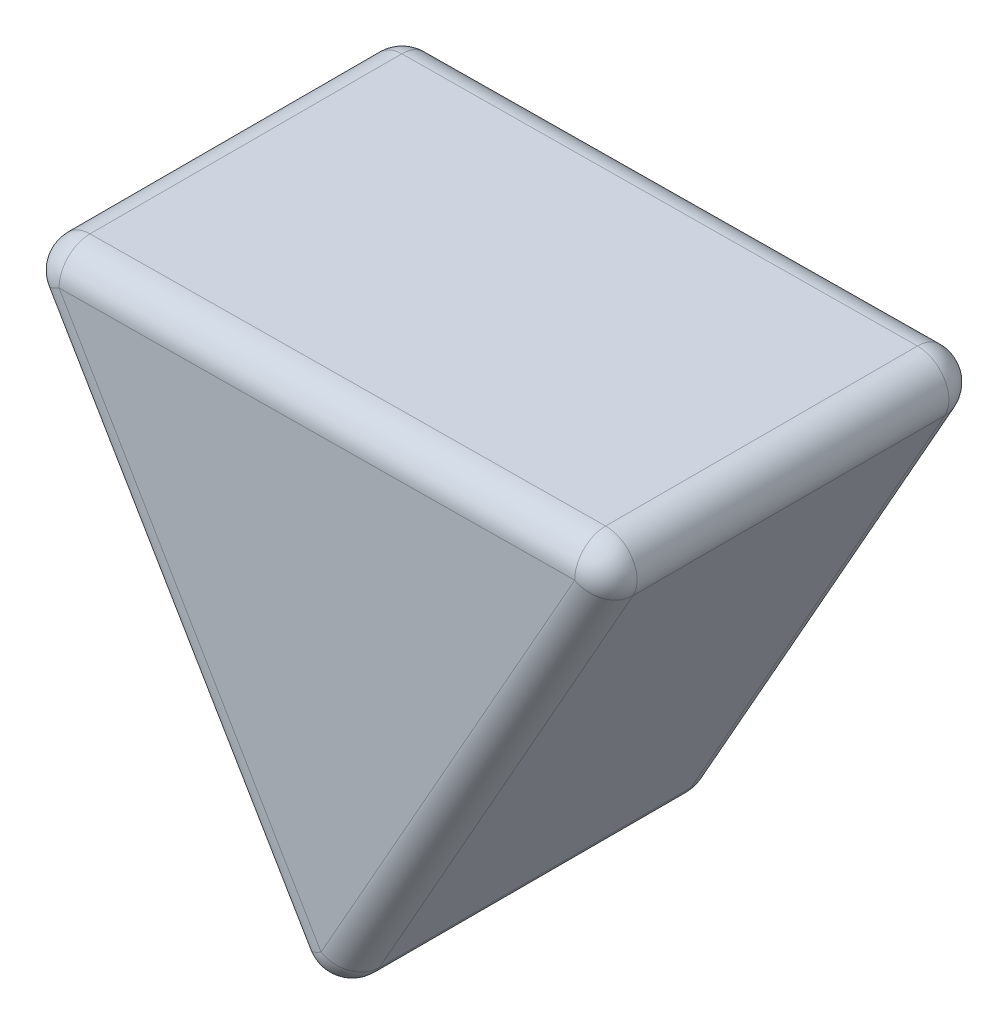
ISO-10303-21;
HEADER;
FILE_DESCRIPTION(('STEP AP214'),'2;1');
FILE_NAME('part.step','',(''),(''),'','','');
FILE_SCHEMA(('AUTOMOTIVE_DESIGN { 1 0 10303 214 1 1 1 1 }'));
ENDSEC;
DATA;
#1=APPLICATION_CONTEXT('core data for automotive mechanical design processes');
#2=APPLICATION_PROTOCOL_DEFINITION('international standard','automotive_design',2000,#1);
#3=PRODUCT_CONTEXT('',#1,'mechanical');
#4=PRODUCT('Part','Part','',(#3));
#5=PRODUCT_RELATED_PRODUCT_CATEGORY('part','',(#4));
#6=PRODUCT_DEFINITION_FORMATION('','',#4);
#7=PRODUCT_DEFINITION_CONTEXT('part definition',#1,'design');
#8=PRODUCT_DEFINITION('design','',#6,#7);
#9=PRODUCT_DEFINITION_SHAPE('','',#8);
#10=(LENGTH_UNIT() NAMED_UNIT(*) SI_UNIT(.MILLI.,.METRE.));
#11=(NAMED_UNIT(*) PLANE_ANGLE_UNIT() SI_UNIT($,.RADIAN.));
#12=(NAMED_UNIT(*) SI_UNIT($,.STERADIAN.) SOLID_ANGLE_UNIT());
#13=UNCERTAINTY_MEASURE_WITH_UNIT(LENGTH_MEASURE(1.E-05),#10,'distance_accuracy_value','');
#14=(GEOMETRIC_REPRESENTATION_CONTEXT(3) GLOBAL_UNCERTAINTY_ASSIGNED_CONTEXT((#13)) GLOBAL_UNIT_ASSIGNED_CONTEXT((#10,
#11,#12)) REPRESENTATION_CONTEXT('',''));
#15=CARTESIAN_POINT('',(0.,0.,0.));
#16=DIRECTION('',(0.,0.,1.));
#17=DIRECTION('',(1.,0.,0.));
#18=AXIS2_PLACEMENT_3D('',#15,#16,#17);
#19=CARTESIAN_POINT('',(-39.8932436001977,-11.5470053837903,12.));
#20=DIRECTION('',(-0.870610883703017,0.491972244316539,0.));
#21=DIRECTION('',(-0.491972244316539,-0.870610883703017,0.));
#22=AXIS2_PLACEMENT_3D('',#19,#20,#21);
#23=PLANE('',#22);
#24=DIRECTION('',(0.491972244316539,0.870610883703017,0.));
#25=VECTOR('',#24,1.);
#26=CARTESIAN_POINT('',(-39.8932436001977,-11.5470053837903,11.));
#27=LINE('',#26,#25);
#28=CARTESIAN_POINT('',(-30.9054991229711,4.35801416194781,11.));
#29=VERTEX_POINT('',#28);
#30=CARTESIAN_POINT('',(-39.0411226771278,-10.0390630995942,11.));
#31=VERTEX_POINT('',#30);
#32=EDGE_CURVE('E158',#29,#31,#27,.F.);
#33=ORIENTED_EDGE('',*,*,#32,.T.);
#34=DIRECTION('',(0.,0.,-1.));
#35=VECTOR('',#34,1.);
#36=CARTESIAN_POINT('',(-39.0411226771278,-10.0390630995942,12.));
#37=LINE('',#36,#35);
#38=CARTESIAN_POINT('',(-39.0411226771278,-10.0390630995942,1.));
#39=VERTEX_POINT('',#38);
#40=EDGE_CURVE('E163',#31,#39,#37,.T.);
#41=ORIENTED_EDGE('',*,*,#40,.T.);
#42=DIRECTION('',(0.491972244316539,0.870610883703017,0.));
#43=VECTOR('',#42,1.);
#44=CARTESIAN_POINT('',(-39.8932436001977,-11.5470053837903,1.));
#45=LINE('',#44,#43);
#46=CARTESIAN_POINT('',(-30.9054991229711,4.35801416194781,1.));
#47=VERTEX_POINT('',#46);
#48=EDGE_CURVE('E160',#39,#47,#45,.T.);
#49=ORIENTED_EDGE('',*,*,#48,.T.);
#50=DIRECTION('',(0.,0.,-1.));
#51=VECTOR('',#50,1.);
#52=CARTESIAN_POINT('',(-30.9054991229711,4.35801416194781,12.));
#53=LINE('',#52,#51);
#54=EDGE_CURVE('E156',#47,#29,#53,.F.);
#55=ORIENTED_EDGE('',*,*,#54,.T.);
#56=EDGE_LOOP('',(#33,#41,#49,#55));
#57=FACE_BOUND('',#56,.T.);
#58=ADVANCED_FACE('F34',(#57),#23,.F.);
#59=CARTESIAN_POINT('',(-30.0533781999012,5.86595644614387,12.));
#60=DIRECTION('',(0.00924498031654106,-0.999957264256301,0.));
#61=DIRECTION('',(0.999957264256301,0.00924498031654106,0.));
#62=AXIS2_PLACEMENT_3D('',#59,#60,#61);
#63=PLANE('',#62);
#64=DIRECTION('',(-0.999957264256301,-0.00924498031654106,0.));
#65=VECTOR('',#64,1.);
#66=CARTESIAN_POINT('',(-30.0533781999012,5.86595644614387,11.));
#67=LINE('',#66,#65);
#68=CARTESIAN_POINT('',(-48.3214014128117,5.69706171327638,11.));
#69=VERTEX_POINT('',#68);
#70=CARTESIAN_POINT('',(-31.7853549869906,5.84994367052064,11.));
#71=VERTEX_POINT('',#70);
#72=EDGE_CURVE('E132',#69,#71,#67,.F.);
#73=ORIENTED_EDGE('',*,*,#72,.T.);
#74=DIRECTION('',(0.,0.,-1.));
#75=VECTOR('',#74,1.);
#76=CARTESIAN_POINT('',(-31.7853549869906,5.84994367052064,12.));
#77=LINE('',#76,#75);
#78=CARTESIAN_POINT('',(-31.7853549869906,5.84994367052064,1.));
#79=VERTEX_POINT('',#78);
#80=EDGE_CURVE('E136',#71,#79,#77,.T.);
#81=ORIENTED_EDGE('',*,*,#80,.T.);
#82=DIRECTION('',(-0.999957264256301,-0.00924498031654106,0.));
#83=VECTOR('',#82,1.);
#84=CARTESIAN_POINT('',(-30.0533781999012,5.86595644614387,1.));
#85=LINE('',#84,#83);
#86=CARTESIAN_POINT('',(-48.3214014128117,5.69706171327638,1.));
#87=VERTEX_POINT('',#86);
#88=EDGE_CURVE('E108',#79,#87,#85,.T.);
#89=ORIENTED_EDGE('',*,*,#88,.T.);
#90=DIRECTION('',(0.,0.,-1.));
#91=VECTOR('',#90,1.);
#92=CARTESIAN_POINT('',(-48.3214014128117,5.69706171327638,12.));
#93=LINE('',#92,#91);
#94=EDGE_CURVE('E126',#87,#69,#93,.F.);
#95=ORIENTED_EDGE('',*,*,#94,.T.);
#96=EDGE_LOOP('',(#73,#81,#89,#95));
#97=FACE_BOUND('',#96,.T.);
#98=ADVANCED_FACE('F134',(#97),#63,.F.);
#99=CARTESIAN_POINT('',(-50.0533781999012,5.68104893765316,12.));
#100=DIRECTION('',(0.861365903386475,0.507985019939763,0.));
#101=DIRECTION('',(-0.507985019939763,0.861365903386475,0.));
#102=AXIS2_PLACEMENT_3D('',#99,#100,#101);
#103=PLANE('',#102);
#104=DIRECTION('',(0.507985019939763,-0.861365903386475,0.));
#105=VECTOR('',#104,1.);
#106=CARTESIAN_POINT('',(-50.0533781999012,5.68104893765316,1.));
#107=LINE('',#106,#105);
#108=CARTESIAN_POINT('',(-49.1735223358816,4.18911942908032,1.));
#109=VERTEX_POINT('',#108);
#110=CARTESIAN_POINT('',(-40.7730994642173,-10.0550758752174,1.));
#111=VERTEX_POINT('',#110);
#112=EDGE_CURVE('E151',#109,#111,#107,.T.);
#113=ORIENTED_EDGE('',*,*,#112,.T.);
#114=DIRECTION('',(0.,0.,-1.));
#115=VECTOR('',#114,1.);
#116=CARTESIAN_POINT('',(-40.7730994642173,-10.0550758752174,12.));
#117=LINE('',#116,#115);
#118=CARTESIAN_POINT('',(-40.7730994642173,-10.0550758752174,11.));
#119=VERTEX_POINT('',#118);
#120=EDGE_CURVE('E154',#111,#119,#117,.F.);
#121=ORIENTED_EDGE('',*,*,#120,.T.);
#122=DIRECTION('',(0.507985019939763,-0.861365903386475,0.));
#123=VECTOR('',#122,1.);
#124=CARTESIAN_POINT('',(-50.0533781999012,5.68104893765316,11.));
#125=LINE('',#124,#123);
#126=CARTESIAN_POINT('',(-49.1735223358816,4.18911942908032,11.));
#127=VERTEX_POINT('',#126);
#128=EDGE_CURVE('E149',#119,#127,#125,.F.);
#129=ORIENTED_EDGE('',*,*,#128,.T.);
#130=DIRECTION('',(0.,0.,-1.));
#131=VECTOR('',#130,1.);
#132=CARTESIAN_POINT('',(-49.1735223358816,4.18911942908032,12.));
#133=LINE('',#132,#131);
#134=EDGE_CURVE('E147',#127,#109,#133,.T.);
#135=ORIENTED_EDGE('',*,*,#134,.T.);
#136=EDGE_LOOP('',(#113,#121,#129,#135));
#137=FACE_BOUND('',#136,.T.);
#138=ADVANCED_FACE('F238',(#137),#103,.F.);
#139=CARTESIAN_POINT('',(0.,0.,12.));
#140=DIRECTION('',(0.,0.,1.));
#141=DIRECTION('',(1.,0.,0.));
#142=AXIS2_PLACEMENT_3D('',#139,#140,#141);
#143=PLANE('',#142);
#144=DIRECTION('',(-0.999957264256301,-0.00924498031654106,0.));
#145=VECTOR('',#144,1.);
#146=CARTESIAN_POINT('',(-50.0441332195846,4.68109167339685,12.));
#147=LINE('',#146,#145);
#148=CARTESIAN_POINT('',(-31.7761100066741,4.84998640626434,12.));
#149=VERTEX_POINT('',#148);
#150=CARTESIAN_POINT('',(-48.3121564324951,4.69710444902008,12.));
#151=VERTEX_POINT('',#150);
#152=EDGE_CURVE('E43',#149,#151,#147,.T.);
#153=ORIENTED_EDGE('',*,*,#152,.T.);
#154=DIRECTION('',(0.507985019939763,-0.861365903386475,0.));
#155=VECTOR('',#154,1.);
#156=CARTESIAN_POINT('',(-39.0318776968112,-11.0390203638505,12.));
#157=LINE('',#156,#155);
#158=CARTESIAN_POINT('',(-39.9117335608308,-9.54709085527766,12.));
#159=VERTEX_POINT('',#158);
#160=EDGE_CURVE('E11',#151,#159,#157,.T.);
#161=ORIENTED_EDGE('',*,*,#160,.T.);
#162=DIRECTION('',(0.491972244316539,0.870610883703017,0.));
#163=VECTOR('',#162,1.);
#164=CARTESIAN_POINT('',(-30.9239890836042,6.3579286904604,12.));
#165=LINE('',#164,#163);
#166=EDGE_CURVE('E53',#159,#149,#165,.T.);
#167=ORIENTED_EDGE('',*,*,#166,.T.);
#168=EDGE_LOOP('',(#153,#161,#167));
#169=FACE_BOUND('',#168,.T.);
#170=ADVANCED_FACE('F235',(#169),#143,.T.);
#171=CARTESIAN_POINT('',(0.,0.,0.));
#172=DIRECTION('',(0.,0.,1.));
#173=DIRECTION('',(1.,0.,0.));
#174=AXIS2_PLACEMENT_3D('',#171,#172,#173);
#175=PLANE('',#174);
#176=DIRECTION('',(0.507985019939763,-0.861365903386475,0.));
#177=VECTOR('',#176,1.);
#178=CARTESIAN_POINT('',(-33.7899937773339,-19.9274322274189,0.));
#179=LINE('',#178,#177);
#180=CARTESIAN_POINT('',(-39.9117335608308,-9.54709085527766,0.));
#181=VERTEX_POINT('',#180);
#182=CARTESIAN_POINT('',(-48.3121564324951,4.69710444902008,0.));
#183=VERTEX_POINT('',#182);
#184=EDGE_CURVE('E144',#181,#183,#179,.F.);
#185=ORIENTED_EDGE('',*,*,#184,.T.);
#186=DIRECTION('',(-0.999957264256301,-0.00924498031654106,0.));
#187=VECTOR('',#186,1.);
#188=CARTESIAN_POINT('',(-0.0475520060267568,5.14332883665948,0.));
#189=LINE('',#188,#187);
#190=CARTESIAN_POINT('',(-31.7761100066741,4.84998640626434,0.));
#191=VERTEX_POINT('',#190);
#192=EDGE_CURVE('E110',#183,#191,#189,.F.);
#193=ORIENTED_EDGE('',*,*,#192,.T.);
#194=DIRECTION('',(0.491972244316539,0.870610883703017,0.));
#195=VECTOR('',#194,1.);
#196=CARTESIAN_POINT('',(-26.1624542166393,14.7841033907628,0.));
#197=LINE('',#196,#195);
#198=EDGE_CURVE('E139',#191,#181,#197,.F.);
#199=ORIENTED_EDGE('',*,*,#198,.T.);
#200=EDGE_LOOP('',(#185,#193,#199));
#201=FACE_BOUND('',#200,.T.);
#202=ADVANCED_FACE('F237',(#201),#175,.F.);
#203=CARTESIAN_POINT('',(-39.9117335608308,-9.54709085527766,11.));
#204=DIRECTION('',(0.,0.,1.));
#205=DIRECTION('',(1.,0.,0.));
#206=AXIS2_PLACEMENT_3D('',#203,#204,#205);
#207=SPHERICAL_SURFACE('',#206,1.);
#208=CARTESIAN_POINT('',(-39.9117335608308,-9.54709085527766,11.));
#209=DIRECTION('',(0.,0.,1.));
#210=DIRECTION('',(1.,0.,0.));
#211=AXIS2_PLACEMENT_3D('',#208,#209,#210);
#212=CIRCLE('',#211,1.);
#213=EDGE_CURVE('E197',#31,#119,#212,.F.);
#214=ORIENTED_EDGE('',*,*,#213,.F.);
#215=CARTESIAN_POINT('',(-39.9117335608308,-9.54709085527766,11.));
#216=DIRECTION('',(-0.49197224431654,-0.870610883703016,0.));
#217=DIRECTION('',(0.870610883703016,-0.49197224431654,0.));
#218=AXIS2_PLACEMENT_3D('',#215,#216,#217);
#219=CIRCLE('',#218,1.);
#220=EDGE_CURVE('E38',#159,#31,#219,.F.);
#221=ORIENTED_EDGE('',*,*,#220,.F.);
#222=CARTESIAN_POINT('',(-39.9117335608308,-9.54709085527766,11.));
#223=DIRECTION('',(0.507985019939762,-0.861365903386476,0.));
#224=DIRECTION('',(0.861365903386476,0.507985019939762,0.));
#225=AXIS2_PLACEMENT_3D('',#222,#223,#224);
#226=CIRCLE('',#225,1.);
#227=EDGE_CURVE('E199',#119,#159,#226,.F.);
#228=ORIENTED_EDGE('',*,*,#227,.F.);
#229=EDGE_LOOP('',(#214,#221,#228));
#230=FACE_BOUND('',#229,.T.);
#231=ADVANCED_FACE('F36',(#230),#207,.T.);
#232=CARTESIAN_POINT('',(-26.1624542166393,14.7841033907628,11.));
#233=DIRECTION('',(-0.491972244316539,-0.870610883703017,0.));
#234=DIRECTION('',(0.870610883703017,-0.491972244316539,0.));
#235=AXIS2_PLACEMENT_3D('',#232,#233,#234);
#236=CYLINDRICAL_SURFACE('',#235,1.);
#237=ORIENTED_EDGE('',*,*,#220,.T.);
#238=ORIENTED_EDGE('',*,*,#32,.F.);
#239=CARTESIAN_POINT('',(-31.7761100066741,4.84998640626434,11.));
#240=DIRECTION('',(0.491972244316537,0.870610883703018,0.));
#241=DIRECTION('',(-0.870610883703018,0.491972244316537,0.));
#242=AXIS2_PLACEMENT_3D('',#239,#240,#241);
#243=CIRCLE('',#242,1.);
#244=EDGE_CURVE('E194',#149,#29,#243,.T.);
#245=ORIENTED_EDGE('',*,*,#244,.F.);
#246=ORIENTED_EDGE('',*,*,#166,.F.);
#247=EDGE_LOOP('',(#237,#238,#245,#246));
#248=FACE_BOUND('',#247,.T.);
#249=ADVANCED_FACE('F209',(#248),#236,.T.);
#250=CARTESIAN_POINT('',(-0.0475520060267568,5.14332883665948,11.));
#251=DIRECTION('',(0.999957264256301,0.00924498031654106,0.));
#252=DIRECTION('',(-0.00924498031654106,0.999957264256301,0.));
#253=AXIS2_PLACEMENT_3D('',#250,#251,#252);
#254=CYLINDRICAL_SURFACE('',#253,1.);
#255=CARTESIAN_POINT('',(-48.3121564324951,4.69710444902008,11.));
#256=DIRECTION('',(-0.999957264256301,-0.00924498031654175,0.));
#257=DIRECTION('',(0.00924498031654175,-0.999957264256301,0.));
#258=AXIS2_PLACEMENT_3D('',#255,#256,#257);
#259=CIRCLE('',#258,1.);
#260=EDGE_CURVE('E188',#151,#69,#259,.T.);
#261=ORIENTED_EDGE('',*,*,#260,.F.);
#262=ORIENTED_EDGE('',*,*,#152,.F.);
#263=CARTESIAN_POINT('',(-31.7761100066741,4.84998640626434,11.));
#264=DIRECTION('',(0.999957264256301,0.00924498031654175,0.));
#265=DIRECTION('',(-0.00924498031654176,0.999957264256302,0.));
#266=AXIS2_PLACEMENT_3D('',#263,#264,#265);
#267=CIRCLE('',#266,1.);
#268=EDGE_CURVE('E191',#71,#149,#267,.T.);
#269=ORIENTED_EDGE('',*,*,#268,.F.);
#270=ORIENTED_EDGE('',*,*,#72,.F.);
#271=EDGE_LOOP('',(#261,#262,#269,#270));
#272=FACE_BOUND('',#271,.T.);
#273=ADVANCED_FACE('F230',(#272),#254,.T.);
#274=CARTESIAN_POINT('',(-33.7899937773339,-19.9274322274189,11.));
#275=DIRECTION('',(-0.507985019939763,0.861365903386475,0.));
#276=DIRECTION('',(-0.861365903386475,-0.507985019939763,0.));
#277=AXIS2_PLACEMENT_3D('',#274,#275,#276);
#278=CYLINDRICAL_SURFACE('',#277,1.);
#279=ORIENTED_EDGE('',*,*,#227,.T.);
#280=ORIENTED_EDGE('',*,*,#160,.F.);
#281=CARTESIAN_POINT('',(-48.3121564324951,4.69710444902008,11.));
#282=DIRECTION('',(-0.507985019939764,0.861365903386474,0.));
#283=DIRECTION('',(-0.861365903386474,-0.507985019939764,0.));
#284=AXIS2_PLACEMENT_3D('',#281,#282,#283);
#285=CIRCLE('',#284,1.);
#286=EDGE_CURVE('E185',#127,#151,#285,.T.);
#287=ORIENTED_EDGE('',*,*,#286,.F.);
#288=ORIENTED_EDGE('',*,*,#128,.F.);
#289=EDGE_LOOP('',(#279,#280,#287,#288));
#290=FACE_BOUND('',#289,.T.);
#291=ADVANCED_FACE('F234',(#290),#278,.T.);
#292=CARTESIAN_POINT('',(-39.9117335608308,-9.54709085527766,12.));
#293=DIRECTION('',(0.,0.,-1.));
#294=DIRECTION('',(-1.,0.,0.));
#295=AXIS2_PLACEMENT_3D('',#292,#293,#294);
#296=CYLINDRICAL_SURFACE('',#295,1.);
#297=ORIENTED_EDGE('',*,*,#213,.T.);
#298=ORIENTED_EDGE('',*,*,#120,.F.);
#299=CARTESIAN_POINT('',(-39.9117335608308,-9.54709085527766,1.));
#300=DIRECTION('',(0.,0.,-1.));
#301=DIRECTION('',(-1.,0.,0.));
#302=AXIS2_PLACEMENT_3D('',#299,#300,#301);
#303=CIRCLE('',#302,1.);
#304=EDGE_CURVE('E182',#39,#111,#303,.T.);
#305=ORIENTED_EDGE('',*,*,#304,.F.);
#306=ORIENTED_EDGE('',*,*,#40,.F.);
#307=EDGE_LOOP('',(#297,#298,#305,#306));
#308=FACE_BOUND('',#307,.T.);
#309=ADVANCED_FACE('F216',(#308),#296,.T.);
#310=CARTESIAN_POINT('',(-31.7761100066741,4.84998640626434,11.));
#311=DIRECTION('',(0.,0.,1.));
#312=DIRECTION('',(1.,0.,0.));
#313=AXIS2_PLACEMENT_3D('',#310,#311,#312);
#314=SPHERICAL_SURFACE('',#313,1.);
#315=ORIENTED_EDGE('',*,*,#268,.T.);
#316=ORIENTED_EDGE('',*,*,#244,.T.);
#317=CARTESIAN_POINT('',(-31.7761100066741,4.84998640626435,11.));
#318=DIRECTION('',(0.,0.,1.));
#319=DIRECTION('',(1.,0.,0.));
#320=AXIS2_PLACEMENT_3D('',#317,#318,#319);
#321=CIRCLE('',#320,1.);
#322=EDGE_CURVE('E176',#71,#29,#321,.F.);
#323=ORIENTED_EDGE('',*,*,#322,.F.);
#324=EDGE_LOOP('',(#315,#316,#323));
#325=FACE_BOUND('',#324,.T.);
#326=ADVANCED_FACE('F226',(#325),#314,.T.);
#327=CARTESIAN_POINT('',(-48.3121564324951,4.69710444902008,11.));
#328=DIRECTION('',(0.,0.,1.));
#329=DIRECTION('',(1.,0.,0.));
#330=AXIS2_PLACEMENT_3D('',#327,#328,#329);
#331=SPHERICAL_SURFACE('',#330,1.);
#332=ORIENTED_EDGE('',*,*,#286,.T.);
#333=ORIENTED_EDGE('',*,*,#260,.T.);
#334=CARTESIAN_POINT('',(-48.3121564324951,4.69710444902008,11.));
#335=DIRECTION('',(0.,0.,1.));
#336=DIRECTION('',(1.,0.,0.));
#337=AXIS2_PLACEMENT_3D('',#334,#335,#336);
#338=CIRCLE('',#337,1.);
#339=EDGE_CURVE('E129',#127,#69,#338,.F.);
#340=ORIENTED_EDGE('',*,*,#339,.F.);
#341=EDGE_LOOP('',(#332,#333,#340));
#342=FACE_BOUND('',#341,.T.);
#343=ADVANCED_FACE('F233',(#342),#331,.T.);
#344=CARTESIAN_POINT('',(-39.9117335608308,-9.54709085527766,1.));
#345=DIRECTION('',(0.,0.,1.));
#346=DIRECTION('',(1.,0.,0.));
#347=AXIS2_PLACEMENT_3D('',#344,#345,#346);
#348=SPHERICAL_SURFACE('',#347,1.);
#349=CARTESIAN_POINT('',(-39.9117335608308,-9.54709085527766,1.));
#350=DIRECTION('',(0.507985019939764,-0.861365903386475,0.));
#351=DIRECTION('',(0.861365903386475,0.507985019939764,0.));
#352=AXIS2_PLACEMENT_3D('',#349,#350,#351);
#353=CIRCLE('',#352,1.);
#354=EDGE_CURVE('E173',#181,#111,#353,.F.);
#355=ORIENTED_EDGE('',*,*,#354,.F.);
#356=CARTESIAN_POINT('',(-39.9117335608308,-9.54709085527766,1.));
#357=DIRECTION('',(-0.491972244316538,-0.870610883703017,0.));
#358=DIRECTION('',(0.870610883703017,-0.491972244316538,0.));
#359=AXIS2_PLACEMENT_3D('',#356,#357,#358);
#360=CIRCLE('',#359,1.);
#361=EDGE_CURVE('E179',#39,#181,#360,.F.);
#362=ORIENTED_EDGE('',*,*,#361,.F.);
#363=ORIENTED_EDGE('',*,*,#304,.T.);
#364=EDGE_LOOP('',(#355,#362,#363));
#365=FACE_BOUND('',#364,.T.);
#366=ADVANCED_FACE('F274',(#365),#348,.T.);
#367=CARTESIAN_POINT('',(-40.7638544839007,-11.0550331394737,1.));
#368=DIRECTION('',(0.491972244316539,0.870610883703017,0.));
#369=DIRECTION('',(-0.870610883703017,0.491972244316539,0.));
#370=AXIS2_PLACEMENT_3D('',#367,#368,#369);
#371=CYLINDRICAL_SURFACE('',#370,1.);
#372=ORIENTED_EDGE('',*,*,#361,.T.);
#373=ORIENTED_EDGE('',*,*,#198,.F.);
#374=CARTESIAN_POINT('',(-31.7761100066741,4.84998640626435,1.));
#375=DIRECTION('',(0.491972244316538,0.870610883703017,0.));
#376=DIRECTION('',(-0.870610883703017,0.491972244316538,0.));
#377=AXIS2_PLACEMENT_3D('',#374,#375,#376);
#378=CIRCLE('',#377,1.);
#379=EDGE_CURVE('E170',#47,#191,#378,.T.);
#380=ORIENTED_EDGE('',*,*,#379,.F.);
#381=ORIENTED_EDGE('',*,*,#48,.F.);
#382=EDGE_LOOP('',(#372,#373,#380,#381));
#383=FACE_BOUND('',#382,.T.);
#384=ADVANCED_FACE('F271',(#383),#371,.T.);
#385=CARTESIAN_POINT('',(-31.7761100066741,4.84998640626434,12.));
#386=DIRECTION('',(0.,0.,-1.));
#387=DIRECTION('',(-1.,0.,0.));
#388=AXIS2_PLACEMENT_3D('',#385,#386,#387);
#389=CYLINDRICAL_SURFACE('',#388,1.);
#390=ORIENTED_EDGE('',*,*,#322,.T.);
#391=ORIENTED_EDGE('',*,*,#54,.F.);
#392=CARTESIAN_POINT('',(-31.7761100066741,4.84998640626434,1.));
#393=DIRECTION('',(0.,0.,-1.));
#394=DIRECTION('',(-1.,0.,0.));
#395=AXIS2_PLACEMENT_3D('',#392,#393,#394);
#396=CIRCLE('',#395,1.);
#397=EDGE_CURVE('E123',#79,#47,#396,.T.);
#398=ORIENTED_EDGE('',*,*,#397,.F.);
#399=ORIENTED_EDGE('',*,*,#80,.F.);
#400=EDGE_LOOP('',(#390,#391,#398,#399));
#401=FACE_BOUND('',#400,.T.);
#402=ADVANCED_FACE('F222',(#401),#389,.T.);
#403=CARTESIAN_POINT('',(-48.3121564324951,4.69710444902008,12.));
#404=DIRECTION('',(0.,0.,-1.));
#405=DIRECTION('',(-1.,0.,0.));
#406=AXIS2_PLACEMENT_3D('',#403,#404,#405);
#407=CYLINDRICAL_SURFACE('',#406,1.);
#408=ORIENTED_EDGE('',*,*,#339,.T.);
#409=ORIENTED_EDGE('',*,*,#94,.F.);
#410=CARTESIAN_POINT('',(-48.3121564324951,4.69710444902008,1.));
#411=DIRECTION('',(0.,0.,-1.));
#412=DIRECTION('',(-1.,0.,0.));
#413=AXIS2_PLACEMENT_3D('',#410,#411,#412);
#414=CIRCLE('',#413,1.);
#415=EDGE_CURVE('E116',#109,#87,#414,.T.);
#416=ORIENTED_EDGE('',*,*,#415,.F.);
#417=ORIENTED_EDGE('',*,*,#134,.F.);
#418=EDGE_LOOP('',(#408,#409,#416,#417));
#419=FACE_BOUND('',#418,.T.);
#420=ADVANCED_FACE('F127',(#419),#407,.T.);
#421=CARTESIAN_POINT('',(-49.1920122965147,6.18903395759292,1.));
#422=DIRECTION('',(0.507985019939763,-0.861365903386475,0.));
#423=DIRECTION('',(0.861365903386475,0.507985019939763,0.));
#424=AXIS2_PLACEMENT_3D('',#421,#422,#423);
#425=CYLINDRICAL_SURFACE('',#424,1.);
#426=ORIENTED_EDGE('',*,*,#354,.T.);
#427=ORIENTED_EDGE('',*,*,#112,.F.);
#428=CARTESIAN_POINT('',(-48.3121564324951,4.69710444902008,1.));
#429=DIRECTION('',(-0.507985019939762,0.861365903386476,0.));
#430=DIRECTION('',(-0.861365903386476,-0.507985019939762,0.));
#431=AXIS2_PLACEMENT_3D('',#428,#429,#430);
#432=CIRCLE('',#431,1.);
#433=EDGE_CURVE('E120',#183,#109,#432,.T.);
#434=ORIENTED_EDGE('',*,*,#433,.F.);
#435=ORIENTED_EDGE('',*,*,#184,.F.);
#436=EDGE_LOOP('',(#426,#427,#434,#435));
#437=FACE_BOUND('',#436,.T.);
#438=ADVANCED_FACE('F262',(#437),#425,.T.);
#439=CARTESIAN_POINT('',(-31.7761100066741,4.84998640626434,1.));
#440=DIRECTION('',(0.,0.,1.));
#441=DIRECTION('',(1.,0.,0.));
#442=AXIS2_PLACEMENT_3D('',#439,#440,#441);
#443=SPHERICAL_SURFACE('',#442,1.);
#444=ORIENTED_EDGE('',*,*,#397,.T.);
#445=ORIENTED_EDGE('',*,*,#379,.T.);
#446=CARTESIAN_POINT('',(-31.7761100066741,4.84998640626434,1.));
#447=DIRECTION('',(0.999957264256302,0.00924498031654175,0.));
#448=DIRECTION('',(-0.00924498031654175,0.999957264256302,0.));
#449=AXIS2_PLACEMENT_3D('',#446,#447,#448);
#450=CIRCLE('',#449,1.);
#451=EDGE_CURVE('E113',#79,#191,#450,.F.);
#452=ORIENTED_EDGE('',*,*,#451,.F.);
#453=EDGE_LOOP('',(#444,#445,#452));
#454=FACE_BOUND('',#453,.T.);
#455=ADVANCED_FACE('F259',(#454),#443,.T.);
#456=CARTESIAN_POINT('',(-48.3121564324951,4.69710444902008,1.));
#457=DIRECTION('',(0.,0.,1.));
#458=DIRECTION('',(1.,0.,0.));
#459=AXIS2_PLACEMENT_3D('',#456,#457,#458);
#460=SPHERICAL_SURFACE('',#459,1.);
#461=ORIENTED_EDGE('',*,*,#433,.T.);
#462=ORIENTED_EDGE('',*,*,#415,.T.);
#463=CARTESIAN_POINT('',(-48.3121564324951,4.69710444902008,1.));
#464=DIRECTION('',(-0.999957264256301,-0.00924498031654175,0.));
#465=DIRECTION('',(0.00924498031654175,-0.999957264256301,0.));
#466=AXIS2_PLACEMENT_3D('',#463,#464,#465);
#467=CIRCLE('',#466,1.);
#468=EDGE_CURVE('E104',#183,#87,#467,.F.);
#469=ORIENTED_EDGE('',*,*,#468,.F.);
#470=EDGE_LOOP('',(#461,#462,#469));
#471=FACE_BOUND('',#470,.T.);
#472=ADVANCED_FACE('F118',(#471),#460,.T.);
#473=CARTESIAN_POINT('',(-30.0441332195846,4.86599918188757,1.));
#474=DIRECTION('',(-0.999957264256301,-0.00924498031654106,0.));
#475=DIRECTION('',(0.00924498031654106,-0.999957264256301,0.));
#476=AXIS2_PLACEMENT_3D('',#473,#474,#475);
#477=CYLINDRICAL_SURFACE('',#476,1.);
#478=ORIENTED_EDGE('',*,*,#451,.T.);
#479=ORIENTED_EDGE('',*,*,#192,.F.);
#480=ORIENTED_EDGE('',*,*,#468,.T.);
#481=ORIENTED_EDGE('',*,*,#88,.F.);
#482=EDGE_LOOP('',(#478,#479,#480,#481));
#483=FACE_BOUND('',#482,.T.);
#484=ADVANCED_FACE('F106',(#483),#477,.T.);
#485=CLOSED_SHELL('',(#58,#98,#138,#170,#202,#231,#249,#273,#291,#309,#326,#343,#366,#384,#402,
#420,#438,#455,#472,#484));
#486=MANIFOLD_SOLID_BREP('B2',#485);
#487=ADVANCED_BREP_SHAPE_REPRESENTATION('',(#18,#486),#14);
#488=SHAPE_DEFINITION_REPRESENTATION(#9,#487);
ENDSEC;
END-ISO-10303-21;
